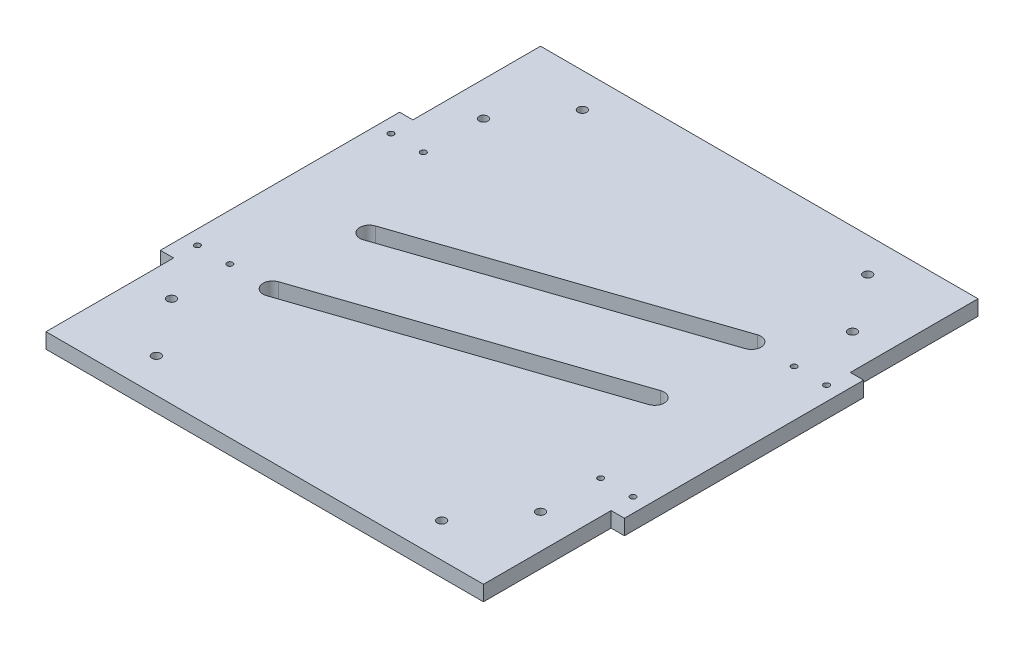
from build123d import *

# Parameters (mm, degrees)
SKETCH1_R           = 2.285
SKETCH1_R_2         = 1.5
BOSS_EXTRUDE1_DEPTH = 8


with BuildPart() as part:
    # Sketch1 → Boss-Extrude1 (new body)
    with BuildSketch(Plane(origin=(0, 0, 0), x_dir=(1, 0, 0), z_dir=(0, 1, 0))):
        Polygon((-115, 130), (115, 130), (115, 62.88), (122, 62.88), (122, -62.88), (115, -62.88), (115, -130), (-115, -130), (-115, -62.88), (-122, -62.88), (-122, 62.88), (-115, 62.88), align=None)
        with Locations(Location((-75, -112, 0), (0, 0, 270))):
            Circle(SKETCH1_R, mode=Mode.SUBTRACT)
        with Locations(Location((-97, -82, 0), (0, 0, 270))):
            Circle(SKETCH1_R, mode=Mode.SUBTRACT)
        with Locations(Location((97, -82, 0), (0, 0, 90))):
            Circle(SKETCH1_R, mode=Mode.SUBTRACT)
        with Locations(Location((75, -112, 0), (0, 0, 90))):
            Circle(SKETCH1_R, mode=Mode.SUBTRACT)
        with Locations(Location((75, 112, 0), (0, 0, 270))):
            Circle(SKETCH1_R, mode=Mode.SUBTRACT)
        with Locations(Location((97, 82, 0), (0, 0, 270))):
            Circle(SKETCH1_R, mode=Mode.SUBTRACT)
        with Locations(Location((-97, 82, 0), (0, 0, 90))):
            Circle(SKETCH1_R, mode=Mode.SUBTRACT)
        with Locations(Location((-75, 112, 0), (0, 0, 90))):
            Circle(SKETCH1_R, mode=Mode.SUBTRACT)
        with Locations(Location((-114.5, 50.875, 0), (0, 0, 270))):
            Circle(SKETCH1_R_2, mode=Mode.SUBTRACT)
        with Locations(Location((-97.5, 50.875, 0), (0, 0, 270))):
            Circle(SKETCH1_R_2, mode=Mode.SUBTRACT)
        with Locations(Location((-114.5, -50.875, 0), (0, 0, 270))):
            Circle(SKETCH1_R_2, mode=Mode.SUBTRACT)
        with Locations(Location((-97.5, -50.875, 0), (0, 0, 270))):
            Circle(SKETCH1_R_2, mode=Mode.SUBTRACT)
        with Locations(Location((97.5, -50.875, 0), (0, 0, 90))):
            Circle(SKETCH1_R_2, mode=Mode.SUBTRACT)
        with Locations(Location((114.5, -50.875, 0), (0, 0, 90))):
            Circle(SKETCH1_R_2, mode=Mode.SUBTRACT)
        with Locations(Location((97.5, 50.875, 0), (0, 0, 90))):
            Circle(SKETCH1_R_2, mode=Mode.SUBTRACT)
        with Locations(Location((114.5, 50.875, 0), (0, 0, 90))):
            Circle(SKETCH1_R_2, mode=Mode.SUBTRACT)
        with BuildLine():
            Line((-76.605976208, 4.735064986), (73.394023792, 55.610064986))
            ThreePointArc((73.394023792, 55.610064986), (79.735064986, 52.480976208), (76.605976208, 46.139935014))
            Line((76.605976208, 46.139935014), (-73.394023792, -4.735064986))
            ThreePointArc((-73.394023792, -4.735064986), (-79.735064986, -1.605976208), (-76.605976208, 4.735064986))
        make_face(mode=Mode.SUBTRACT)
        with BuildLine():
            Line((-76.605976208, -46.139935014), (73.394023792, 4.735064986))
            ThreePointArc((73.394023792, 4.735064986), (79.735064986, 1.605976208), (76.605976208, -4.735064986))
            Line((76.605976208, -4.735064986), (-73.394023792, -55.610064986))
            ThreePointArc((-73.394023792, -55.610064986), (-79.735064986, -52.480976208), (-76.605976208, -46.139935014))
        make_face(mode=Mode.SUBTRACT)
    extrude(amount=BOSS_EXTRUDE1_DEPTH)


solid = part.part
